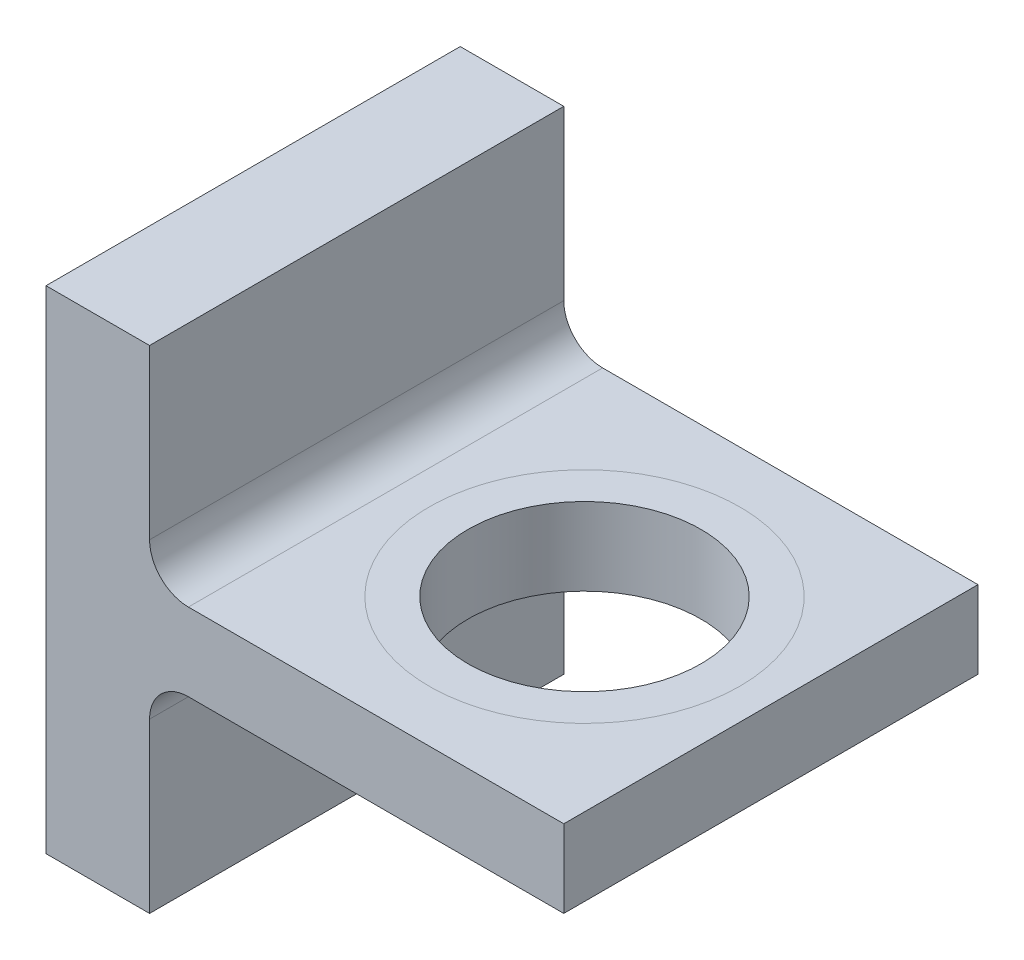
from build123d import *

# Parameters (mm, degrees)
BASE_EXTRUDE_DEPTH      = 50.8
CUT_EXTRUDE8_DEPTH      = 150.494968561
CUT_EXTRUDE8_DEPTH_BACK = 150.494968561
SKETCH6_R               = 28.575
FILLET6_R               = 9.525


with BuildPart() as part:
    # Sketch1 → Base-Extrude (new, symmetric)
    with BuildSketch(Plane.XY):
        Polygon((0, -60.325), (25.4, -60.325), (25.4, -9.525), (127, -9.525), (127, 9.525), (25.4, 9.525), (25.4, 60.325), (0, 60.325), align=None)
    extrude(amount=BASE_EXTRUDE_DEPTH, both=True)

    # Sketch6 → Cut-Extrude8 (cut, two sides: drawn at the far end of the back side and taken through both)
    with BuildSketch(Plane(origin=(0, 0, 0), x_dir=(1, 0, 0), z_dir=(0, 1, 0)).offset(-CUT_EXTRUDE8_DEPTH_BACK)):
        with Locations(Location((81.28, 0, 0), (0, 0, 270))):
            Circle(SKETCH6_R)
    extrude(amount=CUT_EXTRUDE8_DEPTH + CUT_EXTRUDE8_DEPTH_BACK, mode=Mode.SUBTRACT)

    # Fillet6
    fillet6_edges = [part.edges().sort_by_distance(p)[0] for p in [
        (25.4, 9.525, 0),
        (25.4, -9.525, 0),
    ]]
    fillet(fillet6_edges, radius=FILLET6_R)


solid = part.part
